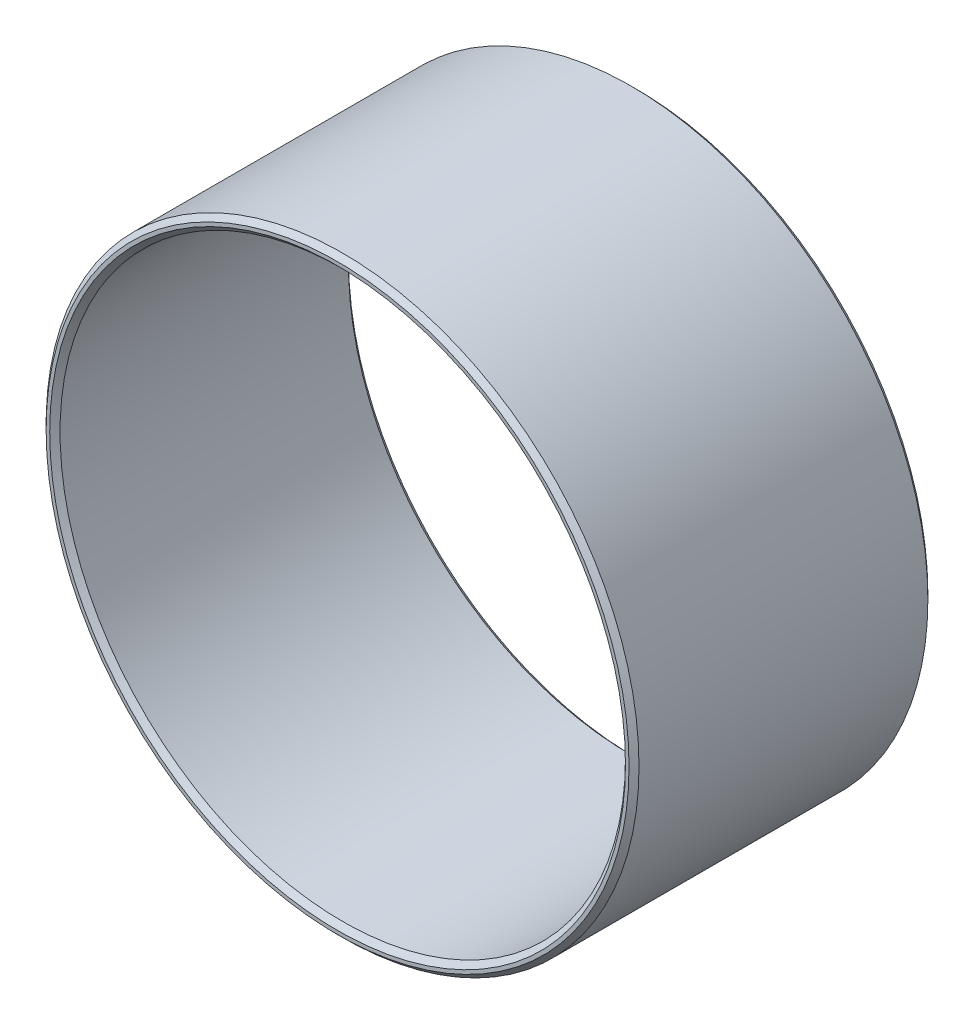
from build123d import *

# Parameters (mm, degrees)
SKETCH1_R      = 188.976
SKETCH1_R_2    = 180.213
EXTRUDE1_DEPTH = 190.5
CHAMFER1_SIZE  = 3.175
CHAMFER3_SIZE  = 3.302


with BuildPart() as part:
    # Sketch1 → Extrude1 (new body)
    with BuildSketch(Plane.XY):
        Circle(SKETCH1_R)
        Circle(SKETCH1_R_2, mode=Mode.SUBTRACT)
    extrude(amount=EXTRUDE1_DEPTH)

    # Chamfer1
    chamfer1_edges = [part.edges().sort_by_distance(p)[0] for p in [
        (-188.976, 0, 0),
        (-188.976, 0, 190.5),
    ]]
    chamfer(chamfer1_edges, length=CHAMFER1_SIZE)

    # Chamfer3
    chamfer3_edges = [part.edges().sort_by_distance(p)[0] for p in [
        (-180.213, 0, 0),
        (-180.213, 0, 190.5),
    ]]
    chamfer(chamfer3_edges, length=CHAMFER3_SIZE)


solid = part.part
